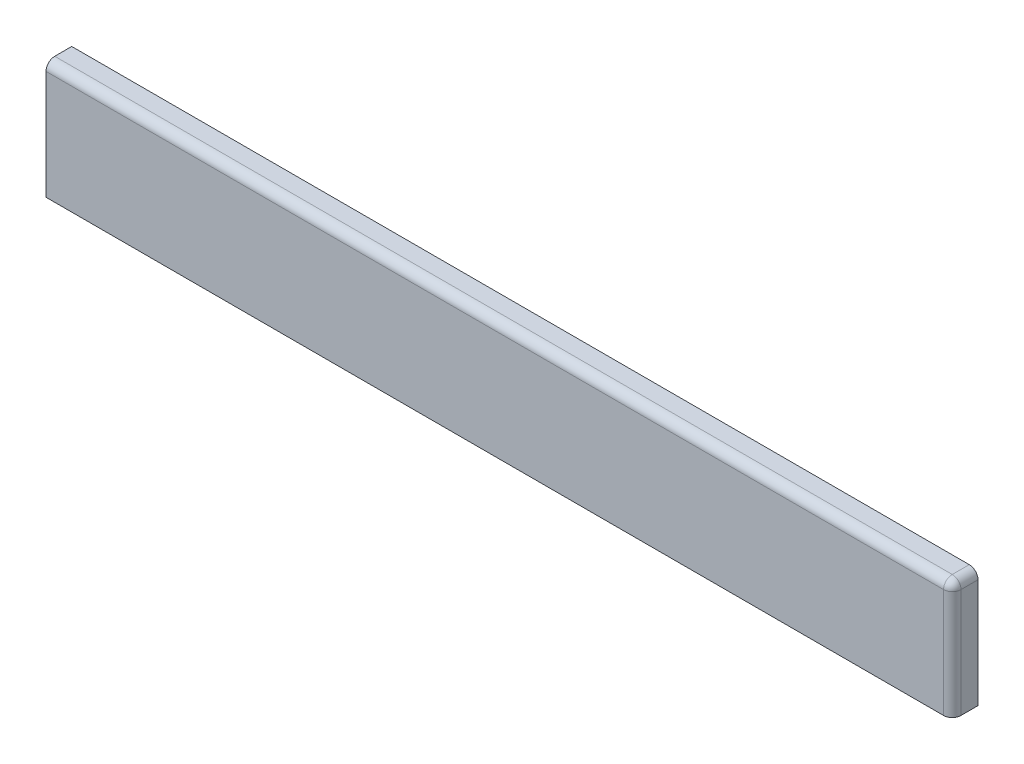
ISO-10303-21;
HEADER;
FILE_DESCRIPTION(('STEP AP214'),'2;1');
FILE_NAME('part.step','',(''),(''),'','','');
FILE_SCHEMA(('AUTOMOTIVE_DESIGN { 1 0 10303 214 1 1 1 1 }'));
ENDSEC;
DATA;
#1=APPLICATION_CONTEXT('core data for automotive mechanical design processes');
#2=APPLICATION_PROTOCOL_DEFINITION('international standard','automotive_design',2000,#1);
#3=PRODUCT_CONTEXT('',#1,'mechanical');
#4=PRODUCT('Part','Part','',(#3));
#5=PRODUCT_RELATED_PRODUCT_CATEGORY('part','',(#4));
#6=PRODUCT_DEFINITION_FORMATION('','',#4);
#7=PRODUCT_DEFINITION_CONTEXT('part definition',#1,'design');
#8=PRODUCT_DEFINITION('design','',#6,#7);
#9=PRODUCT_DEFINITION_SHAPE('','',#8);
#10=(LENGTH_UNIT() NAMED_UNIT(*) SI_UNIT(.MILLI.,.METRE.));
#11=(NAMED_UNIT(*) PLANE_ANGLE_UNIT() SI_UNIT($,.RADIAN.));
#12=(NAMED_UNIT(*) SI_UNIT($,.STERADIAN.) SOLID_ANGLE_UNIT());
#13=UNCERTAINTY_MEASURE_WITH_UNIT(LENGTH_MEASURE(1.E-05),#10,'distance_accuracy_value','');
#14=(GEOMETRIC_REPRESENTATION_CONTEXT(3) GLOBAL_UNCERTAINTY_ASSIGNED_CONTEXT((#13)) GLOBAL_UNIT_ASSIGNED_CONTEXT((#10,
#11,#12)) REPRESENTATION_CONTEXT('',''));
#15=CARTESIAN_POINT('',(0.,0.,0.));
#16=DIRECTION('',(0.,0.,1.));
#17=DIRECTION('',(1.,0.,0.));
#18=AXIS2_PLACEMENT_3D('',#15,#16,#17);
#19=CARTESIAN_POINT('',(0.,0.,0.));
#20=DIRECTION('',(0.,0.,1.));
#21=DIRECTION('',(1.,0.,0.));
#22=AXIS2_PLACEMENT_3D('',#19,#20,#21);
#23=PLANE('',#22);
#24=CARTESIAN_POINT('',(-762.983050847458,-201.991381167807,0.));
#25=DIRECTION('',(0.,0.,-1.));
#26=DIRECTION('',(-1.,0.,0.));
#27=AXIS2_PLACEMENT_3D('',#24,#25,#26);
#28=CIRCLE('',#27,5.00000000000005);
#29=CARTESIAN_POINT('',(-767.983050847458,-201.991381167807,0.));
#30=VERTEX_POINT('',#29);
#31=EDGE_CURVE('E142',#30,#30,#28,.T.);
#32=ORIENTED_EDGE('',*,*,#31,.F.);
#33=EDGE_LOOP('',(#32));
#34=FACE_BOUND('',#33,.T.);
#35=CARTESIAN_POINT('',(-764.,-142.,0.));
#36=DIRECTION('',(0.,0.,-1.));
#37=DIRECTION('',(-1.,0.,0.));
#38=AXIS2_PLACEMENT_3D('',#35,#36,#37);
#39=CIRCLE('',#38,5.00000000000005);
#40=CARTESIAN_POINT('',(-769.,-142.,0.));
#41=VERTEX_POINT('',#40);
#42=EDGE_CURVE('E136',#41,#41,#39,.T.);
#43=ORIENTED_EDGE('',*,*,#42,.F.);
#44=EDGE_LOOP('',(#43));
#45=FACE_BOUND('',#44,.T.);
#46=CARTESIAN_POINT('',(-174.084751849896,-132.,0.));
#47=DIRECTION('',(0.,0.,-1.));
#48=DIRECTION('',(-1.,0.,0.));
#49=AXIS2_PLACEMENT_3D('',#46,#47,#48);
#50=CIRCLE('',#49,4.99999999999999);
#51=CARTESIAN_POINT('',(-179.084751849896,-132.,0.));
#52=VERTEX_POINT('',#51);
#53=EDGE_CURVE('E130',#52,#52,#50,.T.);
#54=ORIENTED_EDGE('',*,*,#53,.F.);
#55=EDGE_LOOP('',(#54));
#56=FACE_BOUND('',#55,.T.);
#57=CARTESIAN_POINT('',(-173.067802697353,-191.991381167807,0.));
#58=DIRECTION('',(0.,0.,-1.));
#59=DIRECTION('',(-1.,0.,0.));
#60=AXIS2_PLACEMENT_3D('',#57,#58,#59);
#61=CIRCLE('',#60,4.99999999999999);
#62=CARTESIAN_POINT('',(-178.067802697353,-191.991381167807,0.));
#63=VERTEX_POINT('',#62);
#64=EDGE_CURVE('E129',#63,#63,#61,.T.);
#65=ORIENTED_EDGE('',*,*,#64,.F.);
#66=EDGE_LOOP('',(#65));
#67=FACE_BOUND('',#66,.T.);
#68=DIRECTION('',(-1.,0.,0.));
#69=VECTOR('',#68,1.);
#70=CARTESIAN_POINT('',(-1009.,0.,0.));
#71=LINE('',#70,#69);
#72=CARTESIAN_POINT('',(1049.,0.,0.));
#73=VERTEX_POINT('',#72);
#74=CARTESIAN_POINT('',(-1009.,0.,0.));
#75=VERTEX_POINT('',#74);
#76=EDGE_CURVE('E229',#73,#75,#71,.T.);
#77=ORIENTED_EDGE('',*,*,#76,.F.);
#78=CARTESIAN_POINT('',(1049.,-20.,0.));
#79=DIRECTION('',(0.,0.,1.));
#80=DIRECTION('',(1.,0.,0.));
#81=AXIS2_PLACEMENT_3D('',#78,#79,#80);
#82=CIRCLE('',#81,20.);
#83=CARTESIAN_POINT('',(1069.,-20.,0.));
#84=VERTEX_POINT('',#83);
#85=EDGE_CURVE('E246',#73,#84,#82,.F.);
#86=ORIENTED_EDGE('',*,*,#85,.T.);
#87=DIRECTION('',(0.,1.,0.));
#88=VECTOR('',#87,1.);
#89=CARTESIAN_POINT('',(1069.,0.,0.));
#90=LINE('',#89,#88);
#91=CARTESIAN_POINT('',(1069.,-270.,0.));
#92=VERTEX_POINT('',#91);
#93=EDGE_CURVE('E228',#92,#84,#90,.T.);
#94=ORIENTED_EDGE('',*,*,#93,.F.);
#95=DIRECTION('',(1.,0.,0.));
#96=VECTOR('',#95,1.);
#97=CARTESIAN_POINT('',(-1009.,-270.,0.));
#98=LINE('',#97,#96);
#99=CARTESIAN_POINT('',(-1009.,-270.,0.));
#100=VERTEX_POINT('',#99);
#101=EDGE_CURVE('E225',#100,#92,#98,.T.);
#102=ORIENTED_EDGE('',*,*,#101,.F.);
#103=DIRECTION('',(0.,-1.,0.));
#104=VECTOR('',#103,1.);
#105=CARTESIAN_POINT('',(-1009.,0.,0.));
#106=LINE('',#105,#104);
#107=EDGE_CURVE('E113',#75,#100,#106,.T.);
#108=ORIENTED_EDGE('',*,*,#107,.F.);
#109=EDGE_LOOP('',(#77,#86,#94,#102,#108));
#110=FACE_BOUND('',#109,.T.);
#111=CARTESIAN_POINT('',(479.,-113.,0.));
#112=DIRECTION('',(0.,0.,1.));
#113=DIRECTION('',(1.,0.,0.));
#114=AXIS2_PLACEMENT_3D('',#111,#112,#113);
#115=CIRCLE('',#114,5.00000000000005);
#116=CARTESIAN_POINT('',(484.,-113.,0.));
#117=VERTEX_POINT('',#116);
#118=EDGE_CURVE('E217',#117,#117,#115,.T.);
#119=ORIENTED_EDGE('',*,*,#118,.T.);
#120=EDGE_LOOP('',(#119));
#121=FACE_BOUND('',#120,.T.);
#122=CARTESIAN_POINT('',(976.,-159.999999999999,0.));
#123=DIRECTION('',(0.,0.,1.));
#124=DIRECTION('',(1.,0.,0.));
#125=AXIS2_PLACEMENT_3D('',#122,#123,#124);
#126=CIRCLE('',#125,5.00000000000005);
#127=CARTESIAN_POINT('',(981.,-159.999999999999,0.));
#128=VERTEX_POINT('',#127);
#129=EDGE_CURVE('E211',#128,#128,#126,.T.);
#130=ORIENTED_EDGE('',*,*,#129,.T.);
#131=EDGE_LOOP('',(#130));
#132=FACE_BOUND('',#131,.T.);
#133=CARTESIAN_POINT('',(929.,-113.,0.));
#134=DIRECTION('',(0.,0.,1.));
#135=DIRECTION('',(1.,0.,0.));
#136=AXIS2_PLACEMENT_3D('',#133,#134,#135);
#137=CIRCLE('',#136,5.00000000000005);
#138=CARTESIAN_POINT('',(934.,-113.,0.));
#139=VERTEX_POINT('',#138);
#140=EDGE_CURVE('E204',#139,#139,#137,.T.);
#141=ORIENTED_EDGE('',*,*,#140,.T.);
#142=EDGE_LOOP('',(#141));
#143=FACE_BOUND('',#142,.T.);
#144=CARTESIAN_POINT('',(29.0000000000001,-113.,0.));
#145=DIRECTION('',(0.,0.,1.));
#146=DIRECTION('',(1.,0.,0.));
#147=AXIS2_PLACEMENT_3D('',#144,#145,#146);
#148=CIRCLE('',#147,5.00000000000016);
#149=CARTESIAN_POINT('',(34.0000000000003,-113.,0.));
#150=VERTEX_POINT('',#149);
#151=EDGE_CURVE('E197',#150,#150,#148,.T.);
#152=ORIENTED_EDGE('',*,*,#151,.T.);
#153=EDGE_LOOP('',(#152));
#154=FACE_BOUND('',#153,.T.);
#155=CARTESIAN_POINT('',(976.,-239.999999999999,0.));
#156=DIRECTION('',(0.,0.,1.));
#157=DIRECTION('',(1.,0.,0.));
#158=AXIS2_PLACEMENT_3D('',#155,#156,#157);
#159=CIRCLE('',#158,5.00000000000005);
#160=CARTESIAN_POINT('',(981.,-239.999999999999,0.));
#161=VERTEX_POINT('',#160);
#162=EDGE_CURVE('E190',#161,#161,#159,.T.);
#163=ORIENTED_EDGE('',*,*,#162,.T.);
#164=EDGE_LOOP('',(#163));
#165=FACE_BOUND('',#164,.T.);
#166=CARTESIAN_POINT('',(-976.,-239.999999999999,0.));
#167=DIRECTION('',(0.,0.,1.));
#168=DIRECTION('',(1.,0.,0.));
#169=AXIS2_PLACEMENT_3D('',#166,#167,#168);
#170=CIRCLE('',#169,5.00000000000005);
#171=CARTESIAN_POINT('',(-971.,-239.999999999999,0.));
#172=VERTEX_POINT('',#171);
#173=EDGE_CURVE('E183',#172,#172,#170,.T.);
#174=ORIENTED_EDGE('',*,*,#173,.T.);
#175=EDGE_LOOP('',(#174));
#176=FACE_BOUND('',#175,.T.);
#177=CARTESIAN_POINT('',(-976.,-159.999999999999,0.));
#178=DIRECTION('',(0.,0.,1.));
#179=DIRECTION('',(1.,0.,0.));
#180=AXIS2_PLACEMENT_3D('',#177,#178,#179);
#181=CIRCLE('',#180,5.00000000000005);
#182=CARTESIAN_POINT('',(-971.,-159.999999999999,0.));
#183=VERTEX_POINT('',#182);
#184=EDGE_CURVE('E176',#183,#183,#181,.T.);
#185=ORIENTED_EDGE('',*,*,#184,.T.);
#186=EDGE_LOOP('',(#185));
#187=FACE_BOUND('',#186,.T.);
#188=CARTESIAN_POINT('',(-897.5,-255.000000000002,0.));
#189=DIRECTION('',(0.,0.,1.));
#190=DIRECTION('',(1.,0.,0.));
#191=AXIS2_PLACEMENT_3D('',#188,#189,#190);
#192=CIRCLE('',#191,5.00000000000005);
#193=CARTESIAN_POINT('',(-892.5,-255.000000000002,0.));
#194=VERTEX_POINT('',#193);
#195=EDGE_CURVE('E169',#194,#194,#192,.T.);
#196=ORIENTED_EDGE('',*,*,#195,.T.);
#197=EDGE_LOOP('',(#196));
#198=FACE_BOUND('',#197,.T.);
#199=CARTESIAN_POINT('',(-299.166666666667,-255.000000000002,0.));
#200=DIRECTION('',(0.,0.,1.));
#201=DIRECTION('',(1.,0.,0.));
#202=AXIS2_PLACEMENT_3D('',#199,#200,#201);
#203=CIRCLE('',#202,4.99999999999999);
#204=CARTESIAN_POINT('',(-294.166666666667,-255.000000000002,0.));
#205=VERTEX_POINT('',#204);
#206=EDGE_CURVE('E162',#205,#205,#203,.T.);
#207=ORIENTED_EDGE('',*,*,#206,.T.);
#208=EDGE_LOOP('',(#207));
#209=FACE_BOUND('',#208,.T.);
#210=CARTESIAN_POINT('',(299.166666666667,-255.000000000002,0.));
#211=DIRECTION('',(0.,0.,1.));
#212=DIRECTION('',(1.,0.,0.));
#213=AXIS2_PLACEMENT_3D('',#210,#211,#212);
#214=CIRCLE('',#213,4.99999999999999);
#215=CARTESIAN_POINT('',(304.166666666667,-255.000000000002,0.));
#216=VERTEX_POINT('',#215);
#217=EDGE_CURVE('E155',#216,#216,#214,.T.);
#218=ORIENTED_EDGE('',*,*,#217,.T.);
#219=EDGE_LOOP('',(#218));
#220=FACE_BOUND('',#219,.T.);
#221=CARTESIAN_POINT('',(897.5,-255.000000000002,0.));
#222=DIRECTION('',(0.,0.,1.));
#223=DIRECTION('',(1.,0.,0.));
#224=AXIS2_PLACEMENT_3D('',#221,#222,#223);
#225=CIRCLE('',#224,5.00000000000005);
#226=CARTESIAN_POINT('',(902.5,-255.000000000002,0.));
#227=VERTEX_POINT('',#226);
#228=EDGE_CURVE('E149',#227,#227,#225,.T.);
#229=ORIENTED_EDGE('',*,*,#228,.T.);
#230=EDGE_LOOP('',(#229));
#231=FACE_BOUND('',#230,.T.);
#232=ADVANCED_FACE('F44',(#34,#45,#56,#67,#110,#121,#132,#143,#154,#165,#176,#187,#198,#209,
#220,#231),#23,.F.);
#233=CARTESIAN_POINT('',(-1009.,0.,16.));
#234=DIRECTION('',(1.,0.,0.));
#235=DIRECTION('',(0.,0.,-1.));
#236=AXIS2_PLACEMENT_3D('',#233,#234,#235);
#237=PLANE('',#236);
#238=DIRECTION('',(0.,1.,0.));
#239=VECTOR('',#238,1.);
#240=CARTESIAN_POINT('',(-1009.,-270.,59.));
#241=LINE('',#240,#239);
#242=CARTESIAN_POINT('',(-1009.,-270.,59.));
#243=VERTEX_POINT('',#242);
#244=CARTESIAN_POINT('',(-1009.,-20.,59.));
#245=VERTEX_POINT('',#244);
#246=EDGE_CURVE('E105',#243,#245,#241,.T.);
#247=ORIENTED_EDGE('',*,*,#246,.T.);
#248=CARTESIAN_POINT('',(-1009.,-20.,39.));
#249=DIRECTION('',(1.,0.,0.));
#250=DIRECTION('',(0.,0.,-1.));
#251=AXIS2_PLACEMENT_3D('',#248,#249,#250);
#252=CIRCLE('',#251,20.);
#253=CARTESIAN_POINT('',(-1009.,0.,39.));
#254=VERTEX_POINT('',#253);
#255=EDGE_CURVE('E237',#245,#254,#252,.F.);
#256=ORIENTED_EDGE('',*,*,#255,.T.);
#257=DIRECTION('',(0.,0.,-1.));
#258=VECTOR('',#257,1.);
#259=CARTESIAN_POINT('',(-1009.,0.,16.));
#260=LINE('',#259,#258);
#261=EDGE_CURVE('E232',#254,#75,#260,.T.);
#262=ORIENTED_EDGE('',*,*,#261,.T.);
#263=ORIENTED_EDGE('',*,*,#107,.T.);
#264=DIRECTION('',(0.,0.,-1.));
#265=VECTOR('',#264,1.);
#266=CARTESIAN_POINT('',(-1009.,-270.,16.));
#267=LINE('',#266,#265);
#268=EDGE_CURVE('E102',#243,#100,#267,.T.);
#269=ORIENTED_EDGE('',*,*,#268,.F.);
#270=EDGE_LOOP('',(#247,#256,#262,#263,#269));
#271=FACE_BOUND('',#270,.T.);
#272=ADVANCED_FACE('F109',(#271),#237,.F.);
#273=CARTESIAN_POINT('',(-1009.,-270.,16.));
#274=DIRECTION('',(0.,1.,0.));
#275=DIRECTION('',(0.,0.,1.));
#276=AXIS2_PLACEMENT_3D('',#273,#274,#275);
#277=PLANE('',#276);
#278=DIRECTION('',(0.,0.,-1.));
#279=VECTOR('',#278,1.);
#280=CARTESIAN_POINT('',(1069.,-270.,16.));
#281=LINE('',#280,#279);
#282=CARTESIAN_POINT('',(1069.,-270.,39.));
#283=VERTEX_POINT('',#282);
#284=EDGE_CURVE('E116',#283,#92,#281,.T.);
#285=ORIENTED_EDGE('',*,*,#284,.F.);
#286=CARTESIAN_POINT('',(1049.,-270.,39.));
#287=DIRECTION('',(0.,1.,0.));
#288=DIRECTION('',(0.,0.,1.));
#289=AXIS2_PLACEMENT_3D('',#286,#287,#288);
#290=CIRCLE('',#289,20.);
#291=CARTESIAN_POINT('',(1049.,-270.,59.));
#292=VERTEX_POINT('',#291);
#293=EDGE_CURVE('E53',#283,#292,#290,.F.);
#294=ORIENTED_EDGE('',*,*,#293,.T.);
#295=DIRECTION('',(-1.,0.,0.));
#296=VECTOR('',#295,1.);
#297=CARTESIAN_POINT('',(1009.,-270.,59.));
#298=LINE('',#297,#296);
#299=EDGE_CURVE('E98',#292,#243,#298,.T.);
#300=ORIENTED_EDGE('',*,*,#299,.T.);
#301=ORIENTED_EDGE('',*,*,#268,.T.);
#302=ORIENTED_EDGE('',*,*,#101,.T.);
#303=EDGE_LOOP('',(#285,#294,#300,#301,#302));
#304=FACE_BOUND('',#303,.T.);
#305=ADVANCED_FACE('F100',(#304),#277,.F.);
#306=CARTESIAN_POINT('',(1069.,0.,16.));
#307=DIRECTION('',(-1.,0.,0.));
#308=DIRECTION('',(0.,0.,1.));
#309=AXIS2_PLACEMENT_3D('',#306,#307,#308);
#310=PLANE('',#309);
#311=ORIENTED_EDGE('',*,*,#93,.T.);
#312=DIRECTION('',(0.,0.,-1.));
#313=VECTOR('',#312,1.);
#314=CARTESIAN_POINT('',(1069.,-20.,16.));
#315=LINE('',#314,#313);
#316=CARTESIAN_POINT('',(1069.,-20.,39.));
#317=VERTEX_POINT('',#316);
#318=EDGE_CURVE('E250',#84,#317,#315,.F.);
#319=ORIENTED_EDGE('',*,*,#318,.T.);
#320=DIRECTION('',(0.,-1.,0.));
#321=VECTOR('',#320,1.);
#322=CARTESIAN_POINT('',(1069.,0.,39.));
#323=LINE('',#322,#321);
#324=EDGE_CURVE('E248',#317,#283,#323,.T.);
#325=ORIENTED_EDGE('',*,*,#324,.T.);
#326=ORIENTED_EDGE('',*,*,#284,.T.);
#327=EDGE_LOOP('',(#311,#319,#325,#326));
#328=FACE_BOUND('',#327,.T.);
#329=ADVANCED_FACE('F268',(#328),#310,.F.);
#330=CARTESIAN_POINT('',(-1009.,0.,16.));
#331=DIRECTION('',(0.,-1.,0.));
#332=DIRECTION('',(0.,0.,-1.));
#333=AXIS2_PLACEMENT_3D('',#330,#331,#332);
#334=PLANE('',#333);
#335=DIRECTION('',(1.,0.,0.));
#336=VECTOR('',#335,1.);
#337=CARTESIAN_POINT('',(-1009.,0.,39.));
#338=LINE('',#337,#336);
#339=CARTESIAN_POINT('',(1049.,0.,39.));
#340=VERTEX_POINT('',#339);
#341=EDGE_CURVE('E115',#254,#340,#338,.T.);
#342=ORIENTED_EDGE('',*,*,#341,.T.);
#343=DIRECTION('',(0.,0.,-1.));
#344=VECTOR('',#343,1.);
#345=CARTESIAN_POINT('',(1049.,0.,16.));
#346=LINE('',#345,#344);
#347=EDGE_CURVE('E239',#340,#73,#346,.T.);
#348=ORIENTED_EDGE('',*,*,#347,.T.);
#349=ORIENTED_EDGE('',*,*,#76,.T.);
#350=ORIENTED_EDGE('',*,*,#261,.F.);
#351=EDGE_LOOP('',(#342,#348,#349,#350));
#352=FACE_BOUND('',#351,.T.);
#353=ADVANCED_FACE('F275',(#352),#334,.F.);
#354=CARTESIAN_POINT('',(479.,-113.,16.));
#355=DIRECTION('',(0.,0.,-1.));
#356=DIRECTION('',(-1.,0.,0.));
#357=AXIS2_PLACEMENT_3D('',#354,#355,#356);
#358=CYLINDRICAL_SURFACE('',#357,5.00000000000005);
#359=CARTESIAN_POINT('',(479.,-113.,16.));
#360=DIRECTION('',(0.,0.,1.));
#361=DIRECTION('',(1.,0.,0.));
#362=AXIS2_PLACEMENT_3D('',#359,#360,#361);
#363=CIRCLE('',#362,5.00000000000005);
#364=CARTESIAN_POINT('',(484.,-113.,16.));
#365=VERTEX_POINT('',#364);
#366=EDGE_CURVE('E207',#365,#365,#363,.T.);
#367=ORIENTED_EDGE('',*,*,#366,.T.);
#368=EDGE_LOOP('',(#367));
#369=FACE_BOUND('',#368,.T.);
#370=ORIENTED_EDGE('',*,*,#118,.F.);
#371=EDGE_LOOP('',(#370));
#372=FACE_BOUND('',#371,.T.);
#373=ADVANCED_FACE('F303',(#369,#372),#358,.F.);
#374=CARTESIAN_POINT('',(976.,-159.999999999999,16.));
#375=DIRECTION('',(0.,0.,-1.));
#376=DIRECTION('',(-1.,0.,0.));
#377=AXIS2_PLACEMENT_3D('',#374,#375,#376);
#378=CYLINDRICAL_SURFACE('',#377,5.00000000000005);
#379=CARTESIAN_POINT('',(976.,-159.999999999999,16.));
#380=DIRECTION('',(0.,0.,1.));
#381=DIRECTION('',(1.,0.,0.));
#382=AXIS2_PLACEMENT_3D('',#379,#380,#381);
#383=CIRCLE('',#382,5.00000000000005);
#384=CARTESIAN_POINT('',(981.,-159.999999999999,16.));
#385=VERTEX_POINT('',#384);
#386=EDGE_CURVE('E200',#385,#385,#383,.T.);
#387=ORIENTED_EDGE('',*,*,#386,.T.);
#388=EDGE_LOOP('',(#387));
#389=FACE_BOUND('',#388,.T.);
#390=ORIENTED_EDGE('',*,*,#129,.F.);
#391=EDGE_LOOP('',(#390));
#392=FACE_BOUND('',#391,.T.);
#393=ADVANCED_FACE('F624',(#389,#392),#378,.F.);
#394=CARTESIAN_POINT('',(929.,-113.,16.));
#395=DIRECTION('',(0.,0.,-1.));
#396=DIRECTION('',(-1.,0.,0.));
#397=AXIS2_PLACEMENT_3D('',#394,#395,#396);
#398=CYLINDRICAL_SURFACE('',#397,5.00000000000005);
#399=CARTESIAN_POINT('',(929.,-113.,16.));
#400=DIRECTION('',(0.,0.,1.));
#401=DIRECTION('',(1.,0.,0.));
#402=AXIS2_PLACEMENT_3D('',#399,#400,#401);
#403=CIRCLE('',#402,5.00000000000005);
#404=CARTESIAN_POINT('',(934.,-113.,16.));
#405=VERTEX_POINT('',#404);
#406=EDGE_CURVE('E193',#405,#405,#403,.T.);
#407=ORIENTED_EDGE('',*,*,#406,.T.);
#408=EDGE_LOOP('',(#407));
#409=FACE_BOUND('',#408,.T.);
#410=ORIENTED_EDGE('',*,*,#140,.F.);
#411=EDGE_LOOP('',(#410));
#412=FACE_BOUND('',#411,.T.);
#413=ADVANCED_FACE('F614',(#409,#412),#398,.F.);
#414=CARTESIAN_POINT('',(29.0000000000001,-113.,16.));
#415=DIRECTION('',(0.,0.,-1.));
#416=DIRECTION('',(-1.,0.,0.));
#417=AXIS2_PLACEMENT_3D('',#414,#415,#416);
#418=CYLINDRICAL_SURFACE('',#417,5.00000000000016);
#419=CARTESIAN_POINT('',(29.0000000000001,-113.,16.));
#420=DIRECTION('',(0.,0.,1.));
#421=DIRECTION('',(1.,0.,0.));
#422=AXIS2_PLACEMENT_3D('',#419,#420,#421);
#423=CIRCLE('',#422,5.00000000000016);
#424=CARTESIAN_POINT('',(34.0000000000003,-113.,16.));
#425=VERTEX_POINT('',#424);
#426=EDGE_CURVE('E186',#425,#425,#423,.T.);
#427=ORIENTED_EDGE('',*,*,#426,.T.);
#428=EDGE_LOOP('',(#427));
#429=FACE_BOUND('',#428,.T.);
#430=ORIENTED_EDGE('',*,*,#151,.F.);
#431=EDGE_LOOP('',(#430));
#432=FACE_BOUND('',#431,.T.);
#433=ADVANCED_FACE('F604',(#429,#432),#418,.F.);
#434=CARTESIAN_POINT('',(976.,-239.999999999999,16.));
#435=DIRECTION('',(0.,0.,-1.));
#436=DIRECTION('',(-1.,0.,0.));
#437=AXIS2_PLACEMENT_3D('',#434,#435,#436);
#438=CYLINDRICAL_SURFACE('',#437,5.00000000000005);
#439=CARTESIAN_POINT('',(976.,-239.999999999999,16.));
#440=DIRECTION('',(0.,0.,1.));
#441=DIRECTION('',(1.,0.,0.));
#442=AXIS2_PLACEMENT_3D('',#439,#440,#441);
#443=CIRCLE('',#442,5.00000000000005);
#444=CARTESIAN_POINT('',(981.,-239.999999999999,16.));
#445=VERTEX_POINT('',#444);
#446=EDGE_CURVE('E179',#445,#445,#443,.T.);
#447=ORIENTED_EDGE('',*,*,#446,.T.);
#448=EDGE_LOOP('',(#447));
#449=FACE_BOUND('',#448,.T.);
#450=ORIENTED_EDGE('',*,*,#162,.F.);
#451=EDGE_LOOP('',(#450));
#452=FACE_BOUND('',#451,.T.);
#453=ADVANCED_FACE('F594',(#449,#452),#438,.F.);
#454=CARTESIAN_POINT('',(-976.,-239.999999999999,16.));
#455=DIRECTION('',(0.,0.,-1.));
#456=DIRECTION('',(-1.,0.,0.));
#457=AXIS2_PLACEMENT_3D('',#454,#455,#456);
#458=CYLINDRICAL_SURFACE('',#457,5.00000000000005);
#459=CARTESIAN_POINT('',(-976.,-239.999999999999,16.));
#460=DIRECTION('',(0.,0.,1.));
#461=DIRECTION('',(1.,0.,0.));
#462=AXIS2_PLACEMENT_3D('',#459,#460,#461);
#463=CIRCLE('',#462,5.00000000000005);
#464=CARTESIAN_POINT('',(-971.,-239.999999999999,16.));
#465=VERTEX_POINT('',#464);
#466=EDGE_CURVE('E172',#465,#465,#463,.T.);
#467=ORIENTED_EDGE('',*,*,#466,.T.);
#468=EDGE_LOOP('',(#467));
#469=FACE_BOUND('',#468,.T.);
#470=ORIENTED_EDGE('',*,*,#173,.F.);
#471=EDGE_LOOP('',(#470));
#472=FACE_BOUND('',#471,.T.);
#473=ADVANCED_FACE('F584',(#469,#472),#458,.F.);
#474=CARTESIAN_POINT('',(-976.,-159.999999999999,16.));
#475=DIRECTION('',(0.,0.,-1.));
#476=DIRECTION('',(-1.,0.,0.));
#477=AXIS2_PLACEMENT_3D('',#474,#475,#476);
#478=CYLINDRICAL_SURFACE('',#477,5.00000000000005);
#479=CARTESIAN_POINT('',(-976.,-159.999999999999,16.));
#480=DIRECTION('',(0.,0.,1.));
#481=DIRECTION('',(1.,0.,0.));
#482=AXIS2_PLACEMENT_3D('',#479,#480,#481);
#483=CIRCLE('',#482,5.00000000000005);
#484=CARTESIAN_POINT('',(-971.,-159.999999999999,16.));
#485=VERTEX_POINT('',#484);
#486=EDGE_CURVE('E165',#485,#485,#483,.T.);
#487=ORIENTED_EDGE('',*,*,#486,.T.);
#488=EDGE_LOOP('',(#487));
#489=FACE_BOUND('',#488,.T.);
#490=ORIENTED_EDGE('',*,*,#184,.F.);
#491=EDGE_LOOP('',(#490));
#492=FACE_BOUND('',#491,.T.);
#493=ADVANCED_FACE('F574',(#489,#492),#478,.F.);
#494=CARTESIAN_POINT('',(-897.5,-255.000000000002,16.));
#495=DIRECTION('',(0.,0.,-1.));
#496=DIRECTION('',(-1.,0.,0.));
#497=AXIS2_PLACEMENT_3D('',#494,#495,#496);
#498=CYLINDRICAL_SURFACE('',#497,5.00000000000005);
#499=CARTESIAN_POINT('',(-897.5,-255.000000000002,16.));
#500=DIRECTION('',(0.,0.,1.));
#501=DIRECTION('',(1.,0.,0.));
#502=AXIS2_PLACEMENT_3D('',#499,#500,#501);
#503=CIRCLE('',#502,5.00000000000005);
#504=CARTESIAN_POINT('',(-892.5,-255.000000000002,16.));
#505=VERTEX_POINT('',#504);
#506=EDGE_CURVE('E158',#505,#505,#503,.T.);
#507=ORIENTED_EDGE('',*,*,#506,.T.);
#508=EDGE_LOOP('',(#507));
#509=FACE_BOUND('',#508,.T.);
#510=ORIENTED_EDGE('',*,*,#195,.F.);
#511=EDGE_LOOP('',(#510));
#512=FACE_BOUND('',#511,.T.);
#513=ADVANCED_FACE('F565',(#509,#512),#498,.F.);
#514=CARTESIAN_POINT('',(-299.166666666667,-255.000000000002,16.));
#515=DIRECTION('',(0.,0.,-1.));
#516=DIRECTION('',(-1.,0.,0.));
#517=AXIS2_PLACEMENT_3D('',#514,#515,#516);
#518=CYLINDRICAL_SURFACE('',#517,4.99999999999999);
#519=CARTESIAN_POINT('',(-299.166666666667,-255.000000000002,16.));
#520=DIRECTION('',(0.,0.,1.));
#521=DIRECTION('',(1.,0.,0.));
#522=AXIS2_PLACEMENT_3D('',#519,#520,#521);
#523=CIRCLE('',#522,4.99999999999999);
#524=CARTESIAN_POINT('',(-294.166666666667,-255.000000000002,16.));
#525=VERTEX_POINT('',#524);
#526=EDGE_CURVE('E123',#525,#525,#523,.T.);
#527=ORIENTED_EDGE('',*,*,#526,.T.);
#528=EDGE_LOOP('',(#527));
#529=FACE_BOUND('',#528,.T.);
#530=ORIENTED_EDGE('',*,*,#206,.F.);
#531=EDGE_LOOP('',(#530));
#532=FACE_BOUND('',#531,.T.);
#533=ADVANCED_FACE('F556',(#529,#532),#518,.F.);
#534=CARTESIAN_POINT('',(299.166666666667,-255.000000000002,16.));
#535=DIRECTION('',(0.,0.,-1.));
#536=DIRECTION('',(-1.,0.,0.));
#537=AXIS2_PLACEMENT_3D('',#534,#535,#536);
#538=CYLINDRICAL_SURFACE('',#537,4.99999999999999);
#539=CARTESIAN_POINT('',(299.166666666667,-255.000000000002,16.));
#540=DIRECTION('',(0.,0.,1.));
#541=DIRECTION('',(1.,0.,0.));
#542=AXIS2_PLACEMENT_3D('',#539,#540,#541);
#543=CIRCLE('',#542,4.99999999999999);
#544=CARTESIAN_POINT('',(304.166666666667,-255.000000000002,16.));
#545=VERTEX_POINT('',#544);
#546=EDGE_CURVE('E145',#545,#545,#543,.T.);
#547=ORIENTED_EDGE('',*,*,#546,.T.);
#548=EDGE_LOOP('',(#547));
#549=FACE_BOUND('',#548,.T.);
#550=ORIENTED_EDGE('',*,*,#217,.F.);
#551=EDGE_LOOP('',(#550));
#552=FACE_BOUND('',#551,.T.);
#553=ADVANCED_FACE('F547',(#549,#552),#538,.F.);
#554=CARTESIAN_POINT('',(897.5,-255.000000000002,16.));
#555=DIRECTION('',(0.,0.,-1.));
#556=DIRECTION('',(-1.,0.,0.));
#557=AXIS2_PLACEMENT_3D('',#554,#555,#556);
#558=CYLINDRICAL_SURFACE('',#557,5.00000000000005);
#559=CARTESIAN_POINT('',(897.5,-255.000000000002,16.));
#560=DIRECTION('',(0.,0.,1.));
#561=DIRECTION('',(1.,0.,0.));
#562=AXIS2_PLACEMENT_3D('',#559,#560,#561);
#563=CIRCLE('',#562,5.00000000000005);
#564=CARTESIAN_POINT('',(902.5,-255.000000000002,16.));
#565=VERTEX_POINT('',#564);
#566=EDGE_CURVE('E120',#565,#565,#563,.T.);
#567=ORIENTED_EDGE('',*,*,#566,.T.);
#568=EDGE_LOOP('',(#567));
#569=FACE_BOUND('',#568,.T.);
#570=ORIENTED_EDGE('',*,*,#228,.F.);
#571=EDGE_LOOP('',(#570));
#572=FACE_BOUND('',#571,.T.);
#573=ADVANCED_FACE('F537',(#569,#572),#558,.F.);
#574=CARTESIAN_POINT('',(-173.067802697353,-191.991381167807,16.));
#575=DIRECTION('',(0.,0.,-1.));
#576=DIRECTION('',(-1.,0.,0.));
#577=AXIS2_PLACEMENT_3D('',#574,#575,#576);
#578=CYLINDRICAL_SURFACE('',#577,4.99999999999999);
#579=CARTESIAN_POINT('',(-173.067802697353,-191.991381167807,16.));
#580=DIRECTION('',(0.,0.,-1.));
#581=DIRECTION('',(-1.,0.,0.));
#582=AXIS2_PLACEMENT_3D('',#579,#580,#581);
#583=CIRCLE('',#582,4.99999999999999);
#584=CARTESIAN_POINT('',(-178.067802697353,-191.991381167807,16.));
#585=VERTEX_POINT('',#584);
#586=EDGE_CURVE('E146',#585,#585,#583,.T.);
#587=ORIENTED_EDGE('',*,*,#586,.F.);
#588=EDGE_LOOP('',(#587));
#589=FACE_BOUND('',#588,.T.);
#590=ORIENTED_EDGE('',*,*,#64,.T.);
#591=EDGE_LOOP('',(#590));
#592=FACE_BOUND('',#591,.T.);
#593=ADVANCED_FACE('F527',(#589,#592),#578,.F.);
#594=CARTESIAN_POINT('',(-174.084751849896,-132.,16.));
#595=DIRECTION('',(0.,0.,-1.));
#596=DIRECTION('',(-1.,0.,0.));
#597=AXIS2_PLACEMENT_3D('',#594,#595,#596);
#598=CYLINDRICAL_SURFACE('',#597,4.99999999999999);
#599=CARTESIAN_POINT('',(-174.084751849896,-132.,16.));
#600=DIRECTION('',(0.,0.,-1.));
#601=DIRECTION('',(-1.,0.,0.));
#602=AXIS2_PLACEMENT_3D('',#599,#600,#601);
#603=CIRCLE('',#602,4.99999999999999);
#604=CARTESIAN_POINT('',(-179.084751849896,-132.,16.));
#605=VERTEX_POINT('',#604);
#606=EDGE_CURVE('E126',#605,#605,#603,.T.);
#607=ORIENTED_EDGE('',*,*,#606,.F.);
#608=EDGE_LOOP('',(#607));
#609=FACE_BOUND('',#608,.T.);
#610=ORIENTED_EDGE('',*,*,#53,.T.);
#611=EDGE_LOOP('',(#610));
#612=FACE_BOUND('',#611,.T.);
#613=ADVANCED_FACE('F517',(#609,#612),#598,.F.);
#614=CARTESIAN_POINT('',(-764.,-142.,16.));
#615=DIRECTION('',(0.,0.,-1.));
#616=DIRECTION('',(-1.,0.,0.));
#617=AXIS2_PLACEMENT_3D('',#614,#615,#616);
#618=CYLINDRICAL_SURFACE('',#617,5.00000000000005);
#619=CARTESIAN_POINT('',(-764.,-142.,16.));
#620=DIRECTION('',(0.,0.,-1.));
#621=DIRECTION('',(-1.,0.,0.));
#622=AXIS2_PLACEMENT_3D('',#619,#620,#621);
#623=CIRCLE('',#622,5.00000000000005);
#624=CARTESIAN_POINT('',(-769.,-142.,16.));
#625=VERTEX_POINT('',#624);
#626=EDGE_CURVE('E133',#625,#625,#623,.T.);
#627=ORIENTED_EDGE('',*,*,#626,.F.);
#628=EDGE_LOOP('',(#627));
#629=FACE_BOUND('',#628,.T.);
#630=ORIENTED_EDGE('',*,*,#42,.T.);
#631=EDGE_LOOP('',(#630));
#632=FACE_BOUND('',#631,.T.);
#633=ADVANCED_FACE('F507',(#629,#632),#618,.F.);
#634=CARTESIAN_POINT('',(-762.983050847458,-201.991381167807,16.));
#635=DIRECTION('',(0.,0.,-1.));
#636=DIRECTION('',(-1.,0.,0.));
#637=AXIS2_PLACEMENT_3D('',#634,#635,#636);
#638=CYLINDRICAL_SURFACE('',#637,5.00000000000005);
#639=CARTESIAN_POINT('',(-762.983050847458,-201.991381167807,16.));
#640=DIRECTION('',(0.,0.,-1.));
#641=DIRECTION('',(-1.,0.,0.));
#642=AXIS2_PLACEMENT_3D('',#639,#640,#641);
#643=CIRCLE('',#642,5.00000000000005);
#644=CARTESIAN_POINT('',(-767.983050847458,-201.991381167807,16.));
#645=VERTEX_POINT('',#644);
#646=EDGE_CURVE('E139',#645,#645,#643,.T.);
#647=ORIENTED_EDGE('',*,*,#646,.F.);
#648=EDGE_LOOP('',(#647));
#649=FACE_BOUND('',#648,.T.);
#650=ORIENTED_EDGE('',*,*,#31,.T.);
#651=EDGE_LOOP('',(#650));
#652=FACE_BOUND('',#651,.T.);
#653=ADVANCED_FACE('F462',(#649,#652),#638,.F.);
#654=CARTESIAN_POINT('',(0.,0.,16.));
#655=DIRECTION('',(0.,0.,-1.));
#656=DIRECTION('',(-1.,0.,0.));
#657=AXIS2_PLACEMENT_3D('',#654,#655,#656);
#658=PLANE('',#657);
#659=ORIENTED_EDGE('',*,*,#566,.F.);
#660=EDGE_LOOP('',(#659));
#661=FACE_BOUND('',#660,.T.);
#662=ADVANCED_FACE('F376',(#661),#658,.T.);
#663=ORIENTED_EDGE('',*,*,#526,.F.);
#664=EDGE_LOOP('',(#663));
#665=FACE_BOUND('',#664,.T.);
#666=ADVANCED_FACE('F447',(#665),#658,.T.);
#667=ORIENTED_EDGE('',*,*,#486,.F.);
#668=EDGE_LOOP('',(#667));
#669=FACE_BOUND('',#668,.T.);
#670=ADVANCED_FACE('F439',(#669),#658,.T.);
#671=ORIENTED_EDGE('',*,*,#446,.F.);
#672=EDGE_LOOP('',(#671));
#673=FACE_BOUND('',#672,.T.);
#674=ADVANCED_FACE('F431',(#673),#658,.T.);
#675=ORIENTED_EDGE('',*,*,#406,.F.);
#676=EDGE_LOOP('',(#675));
#677=FACE_BOUND('',#676,.T.);
#678=ADVANCED_FACE('F423',(#677),#658,.T.);
#679=ORIENTED_EDGE('',*,*,#366,.F.);
#680=EDGE_LOOP('',(#679));
#681=FACE_BOUND('',#680,.T.);
#682=ADVANCED_FACE('F415',(#681),#658,.T.);
#683=ORIENTED_EDGE('',*,*,#386,.F.);
#684=EDGE_LOOP('',(#683));
#685=FACE_BOUND('',#684,.T.);
#686=ADVANCED_FACE('F407',(#685),#658,.T.);
#687=ORIENTED_EDGE('',*,*,#426,.F.);
#688=EDGE_LOOP('',(#687));
#689=FACE_BOUND('',#688,.T.);
#690=ADVANCED_FACE('F399',(#689),#658,.T.);
#691=ORIENTED_EDGE('',*,*,#466,.F.);
#692=EDGE_LOOP('',(#691));
#693=FACE_BOUND('',#692,.T.);
#694=ADVANCED_FACE('F391',(#693),#658,.T.);
#695=ORIENTED_EDGE('',*,*,#506,.F.);
#696=EDGE_LOOP('',(#695));
#697=FACE_BOUND('',#696,.T.);
#698=ADVANCED_FACE('F383',(#697),#658,.T.);
#699=ORIENTED_EDGE('',*,*,#546,.F.);
#700=EDGE_LOOP('',(#699));
#701=FACE_BOUND('',#700,.T.);
#702=ADVANCED_FACE('F368',(#701),#658,.T.);
#703=ORIENTED_EDGE('',*,*,#586,.T.);
#704=EDGE_LOOP('',(#703));
#705=FACE_BOUND('',#704,.T.);
#706=ADVANCED_FACE('F352',(#705),#658,.T.);
#707=ORIENTED_EDGE('',*,*,#606,.T.);
#708=EDGE_LOOP('',(#707));
#709=FACE_BOUND('',#708,.T.);
#710=ADVANCED_FACE('F359',(#709),#658,.T.);
#711=ORIENTED_EDGE('',*,*,#626,.T.);
#712=EDGE_LOOP('',(#711));
#713=FACE_BOUND('',#712,.T.);
#714=ADVANCED_FACE('F349',(#713),#658,.T.);
#715=ORIENTED_EDGE('',*,*,#646,.T.);
#716=EDGE_LOOP('',(#715));
#717=FACE_BOUND('',#716,.T.);
#718=ADVANCED_FACE('F287',(#717),#658,.T.);
#719=CARTESIAN_POINT('',(0.,0.,59.));
#720=DIRECTION('',(0.,0.,-1.));
#721=DIRECTION('',(-1.,0.,0.));
#722=AXIS2_PLACEMENT_3D('',#719,#720,#721);
#723=PLANE('',#722);
#724=ORIENTED_EDGE('',*,*,#299,.F.);
#725=DIRECTION('',(0.,-1.,0.));
#726=VECTOR('',#725,1.);
#727=CARTESIAN_POINT('',(1049.,0.,59.));
#728=LINE('',#727,#726);
#729=CARTESIAN_POINT('',(1049.,-20.,59.));
#730=VERTEX_POINT('',#729);
#731=EDGE_CURVE('E12',#292,#730,#728,.F.);
#732=ORIENTED_EDGE('',*,*,#731,.T.);
#733=DIRECTION('',(1.,0.,0.));
#734=VECTOR('',#733,1.);
#735=CARTESIAN_POINT('',(0.,-20.,59.));
#736=LINE('',#735,#734);
#737=EDGE_CURVE('E119',#730,#245,#736,.F.);
#738=ORIENTED_EDGE('',*,*,#737,.T.);
#739=ORIENTED_EDGE('',*,*,#246,.F.);
#740=EDGE_LOOP('',(#724,#732,#738,#739));
#741=FACE_BOUND('',#740,.T.);
#742=ADVANCED_FACE('F118',(#741),#723,.F.);
#743=CARTESIAN_POINT('',(-1009.,-20.,39.));
#744=DIRECTION('',(1.,0.,0.));
#745=DIRECTION('',(0.,0.,-1.));
#746=AXIS2_PLACEMENT_3D('',#743,#744,#745);
#747=CYLINDRICAL_SURFACE('',#746,20.);
#748=ORIENTED_EDGE('',*,*,#737,.F.);
#749=CARTESIAN_POINT('',(1049.,-20.,39.));
#750=DIRECTION('',(1.,0.,0.));
#751=DIRECTION('',(0.,0.,-1.));
#752=AXIS2_PLACEMENT_3D('',#749,#750,#751);
#753=CIRCLE('',#752,20.);
#754=EDGE_CURVE('E252',#730,#340,#753,.F.);
#755=ORIENTED_EDGE('',*,*,#754,.T.);
#756=ORIENTED_EDGE('',*,*,#341,.F.);
#757=ORIENTED_EDGE('',*,*,#255,.F.);
#758=EDGE_LOOP('',(#748,#755,#756,#757));
#759=FACE_BOUND('',#758,.T.);
#760=ADVANCED_FACE('F279',(#759),#747,.T.);
#761=CARTESIAN_POINT('',(1049.,0.,39.));
#762=DIRECTION('',(0.,-1.,0.));
#763=DIRECTION('',(0.,0.,-1.));
#764=AXIS2_PLACEMENT_3D('',#761,#762,#763);
#765=CYLINDRICAL_SURFACE('',#764,20.);
#766=CARTESIAN_POINT('',(1049.,-20.,39.));
#767=DIRECTION('',(0.,1.,0.));
#768=DIRECTION('',(0.,0.,1.));
#769=AXIS2_PLACEMENT_3D('',#766,#767,#768);
#770=CIRCLE('',#769,20.);
#771=EDGE_CURVE('E48',#730,#317,#770,.T.);
#772=ORIENTED_EDGE('',*,*,#771,.F.);
#773=ORIENTED_EDGE('',*,*,#731,.F.);
#774=ORIENTED_EDGE('',*,*,#293,.F.);
#775=ORIENTED_EDGE('',*,*,#324,.F.);
#776=EDGE_LOOP('',(#772,#773,#774,#775));
#777=FACE_BOUND('',#776,.T.);
#778=ADVANCED_FACE('F46',(#777),#765,.T.);
#779=CARTESIAN_POINT('',(1049.,-20.,39.));
#780=DIRECTION('',(-1.,0.,0.));
#781=DIRECTION('',(0.,0.,1.));
#782=AXIS2_PLACEMENT_3D('',#779,#780,#781);
#783=SPHERICAL_SURFACE('',#782,20.);
#784=ORIENTED_EDGE('',*,*,#754,.F.);
#785=ORIENTED_EDGE('',*,*,#771,.T.);
#786=CARTESIAN_POINT('',(1049.,-20.,39.));
#787=DIRECTION('',(0.,0.,-1.));
#788=DIRECTION('',(-1.,0.,0.));
#789=AXIS2_PLACEMENT_3D('',#786,#787,#788);
#790=CIRCLE('',#789,20.);
#791=EDGE_CURVE('E254',#340,#317,#790,.T.);
#792=ORIENTED_EDGE('',*,*,#791,.F.);
#793=EDGE_LOOP('',(#784,#785,#792));
#794=FACE_BOUND('',#793,.T.);
#795=ADVANCED_FACE('F264',(#794),#783,.T.);
#796=CARTESIAN_POINT('',(1049.,-20.,16.));
#797=DIRECTION('',(0.,0.,-1.));
#798=DIRECTION('',(-1.,0.,0.));
#799=AXIS2_PLACEMENT_3D('',#796,#797,#798);
#800=CYLINDRICAL_SURFACE('',#799,20.);
#801=ORIENTED_EDGE('',*,*,#791,.T.);
#802=ORIENTED_EDGE('',*,*,#318,.F.);
#803=ORIENTED_EDGE('',*,*,#85,.F.);
#804=ORIENTED_EDGE('',*,*,#347,.F.);
#805=EDGE_LOOP('',(#801,#802,#803,#804));
#806=FACE_BOUND('',#805,.T.);
#807=ADVANCED_FACE('F273',(#806),#800,.T.);
#808=CLOSED_SHELL('',(#232,#272,#305,#329,#353,#373,#393,#413,#433,#453,#473,#493,#513,#533,
#553,#573,#593,#613,#633,#653,#662,#666,#670,#674,#678,#682,#686,#690,#694,#698,#702,#706,#710,
#714,#718,#742,#760,#778,#795,#807));
#809=MANIFOLD_SOLID_BREP('B2',#808);
#810=ADVANCED_BREP_SHAPE_REPRESENTATION('',(#18,#809),#14);
#811=SHAPE_DEFINITION_REPRESENTATION(#9,#810);
ENDSEC;
END-ISO-10303-21;
